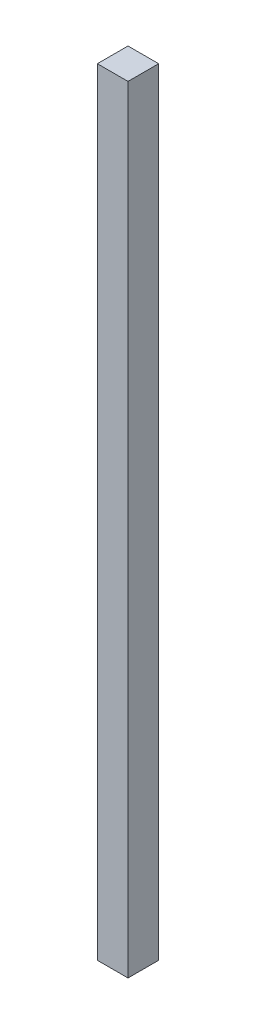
from build123d import *

# Parameters (mm, degrees)
SKETCH_1_W      = 60
SKETCH_1_H      = 60
EXTRUDE_1_DEPTH = 1520


with BuildPart() as part:
    # Sketch 1 → Extrude 1 (new body)
    with BuildSketch(Plane(origin=(0, 0, 0), x_dir=(1, 0, 0), z_dir=(0, 1, 0))):
        Rectangle(SKETCH_1_W, SKETCH_1_H)
    extrude(amount=EXTRUDE_1_DEPTH)


solid = part.part
